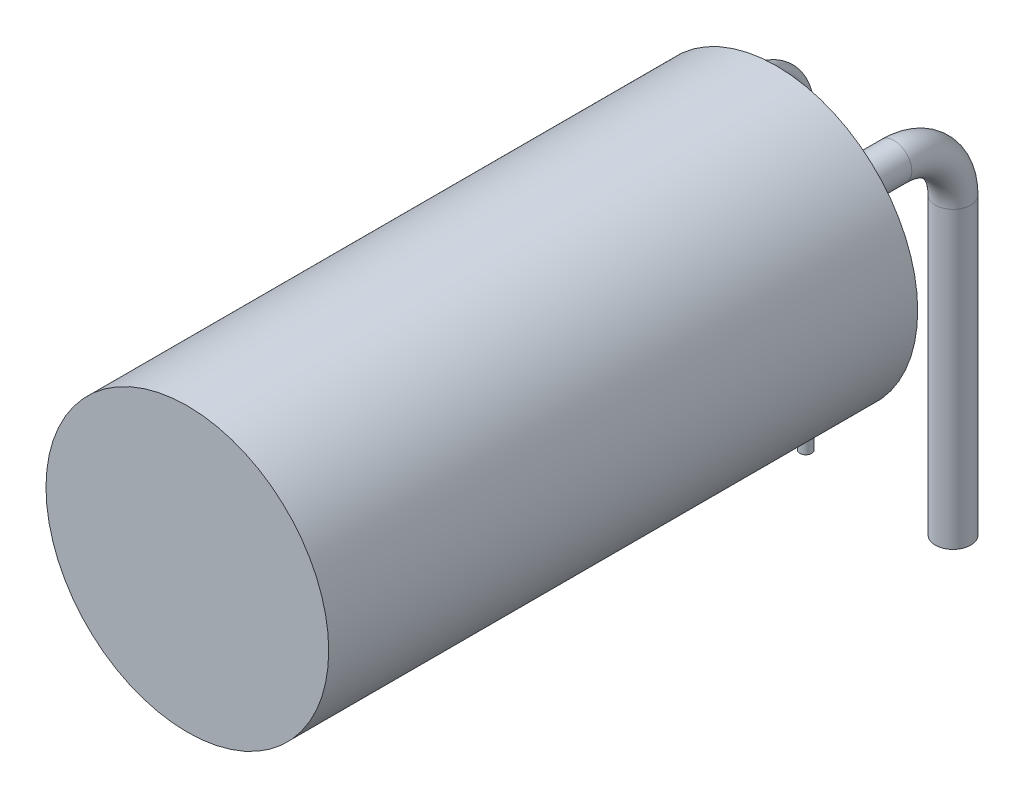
ISO-10303-21;
HEADER;
FILE_DESCRIPTION(('STEP AP214'),'2;1');
FILE_NAME('part.step','',(''),(''),'','','');
FILE_SCHEMA(('AUTOMOTIVE_DESIGN { 1 0 10303 214 1 1 1 1 }'));
ENDSEC;
DATA;
#1=APPLICATION_CONTEXT('core data for automotive mechanical design processes');
#2=APPLICATION_PROTOCOL_DEFINITION('international standard','automotive_design',2000,#1);
#3=PRODUCT_CONTEXT('',#1,'mechanical');
#4=PRODUCT('Part','Part','',(#3));
#5=PRODUCT_RELATED_PRODUCT_CATEGORY('part','',(#4));
#6=PRODUCT_DEFINITION_FORMATION('','',#4);
#7=PRODUCT_DEFINITION_CONTEXT('part definition',#1,'design');
#8=PRODUCT_DEFINITION('design','',#6,#7);
#9=PRODUCT_DEFINITION_SHAPE('','',#8);
#10=(LENGTH_UNIT() NAMED_UNIT(*) SI_UNIT(.MILLI.,.METRE.));
#11=(NAMED_UNIT(*) PLANE_ANGLE_UNIT() SI_UNIT($,.RADIAN.));
#12=(NAMED_UNIT(*) SI_UNIT($,.STERADIAN.) SOLID_ANGLE_UNIT());
#13=UNCERTAINTY_MEASURE_WITH_UNIT(LENGTH_MEASURE(1.E-05),#10,'distance_accuracy_value','');
#14=(GEOMETRIC_REPRESENTATION_CONTEXT(3) GLOBAL_UNCERTAINTY_ASSIGNED_CONTEXT((#13)) GLOBAL_UNIT_ASSIGNED_CONTEXT((#10,
#11,#12)) REPRESENTATION_CONTEXT('',''));
#15=CARTESIAN_POINT('',(0.,0.,0.));
#16=DIRECTION('',(0.,0.,1.));
#17=DIRECTION('',(1.,0.,0.));
#18=AXIS2_PLACEMENT_3D('',#15,#16,#17);
#19=CARTESIAN_POINT('',(0.,0.,0.));
#20=DIRECTION('',(0.,0.,1.));
#21=DIRECTION('',(1.,0.,0.));
#22=AXIS2_PLACEMENT_3D('',#19,#20,#21);
#23=PLANE('',#22);
#24=CARTESIAN_POINT('',(0.,0.,0.));
#25=DIRECTION('',(0.,0.,1.));
#26=DIRECTION('',(1.,0.,0.));
#27=AXIS2_PLACEMENT_3D('',#24,#25,#26);
#28=CIRCLE('',#27,2.4);
#29=CARTESIAN_POINT('',(-2.39996174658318,-0.0135504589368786,0.));
#30=VERTEX_POINT('',#29);
#31=CARTESIAN_POINT('',(-2.39996174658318,0.0135504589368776,0.));
#32=VERTEX_POINT('',#31);
#33=EDGE_CURVE('E38',#30,#32,#28,.T.);
#34=ORIENTED_EDGE('',*,*,#33,.F.);
#35=CARTESIAN_POINT('',(-2.39996174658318,-0.0135504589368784,0.));
#36=CARTESIAN_POINT('',(-2.39820142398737,0.,0.));
#37=CARTESIAN_POINT('',(-2.39996174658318,0.013550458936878,0.));
#38=B_SPLINE_CURVE_WITH_KNOTS('',2,(#35,#36,#37),.UNSPECIFIED.,.F.,.F.,(3,3),(0.,1.),.UNSPECIFIED.);
#39=EDGE_CURVE('E99',#30,#32,#38,.T.);
#40=ORIENTED_EDGE('',*,*,#39,.T.);
#41=EDGE_LOOP('',(#34,#40));
#42=FACE_BOUND('',#41,.T.);
#43=CARTESIAN_POINT('',(0.,0.,0.));
#44=DIRECTION('',(0.,0.,-1.));
#45=DIRECTION('',(-1.,0.,0.));
#46=AXIS2_PLACEMENT_3D('',#43,#44,#45);
#47=CIRCLE('',#46,0.3);
#48=CARTESIAN_POINT('',(-0.3,0.,0.));
#49=VERTEX_POINT('',#48);
#50=EDGE_CURVE('E68',#49,#49,#47,.T.);
#51=ORIENTED_EDGE('',*,*,#50,.F.);
#52=EDGE_LOOP('',(#51));
#53=FACE_BOUND('',#52,.T.);
#54=ADVANCED_FACE('F33',(#42,#53),#23,.F.);
#55=CARTESIAN_POINT('',(0.,0.,10.));
#56=DIRECTION('',(0.,0.,-1.));
#57=DIRECTION('',(-1.,0.,0.));
#58=AXIS2_PLACEMENT_3D('',#55,#56,#57);
#59=CYLINDRICAL_SURFACE('',#58,2.4);
#60=ORIENTED_EDGE('',*,*,#33,.T.);
#61=DIRECTION('',(0.,0.,1.));
#62=VECTOR('',#61,1.);
#63=CARTESIAN_POINT('',(-2.39996174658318,0.0135504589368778,-0.749999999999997));
#64=LINE('',#63,#62);
#65=CARTESIAN_POINT('',(-2.39996174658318,0.0135504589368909,0.5));
#66=VERTEX_POINT('',#65);
#67=EDGE_CURVE('E11',#32,#66,#64,.T.);
#68=ORIENTED_EDGE('',*,*,#67,.T.);
#69=CARTESIAN_POINT('',(0.,0.,0.5));
#70=DIRECTION('',(0.,0.,1.));
#71=DIRECTION('',(-0.999984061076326,0.0056460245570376,0.));
#72=AXIS2_PLACEMENT_3D('',#69,#70,#71);
#73=CIRCLE('',#72,2.4);
#74=CARTESIAN_POINT('',(-2.39996174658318,-0.0135504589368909,0.5));
#75=VERTEX_POINT('',#74);
#76=EDGE_CURVE('E62',#66,#75,#73,.T.);
#77=ORIENTED_EDGE('',*,*,#76,.T.);
#78=DIRECTION('',(0.,0.,1.));
#79=VECTOR('',#78,1.);
#80=CARTESIAN_POINT('',(-2.39996174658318,-0.0135504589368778,-0.749999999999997));
#81=LINE('',#80,#79);
#82=EDGE_CURVE('E44',#75,#30,#81,.F.);
#83=ORIENTED_EDGE('',*,*,#82,.T.);
#84=EDGE_LOOP('',(#60,#68,#77,#83));
#85=FACE_BOUND('',#84,.T.);
#86=CARTESIAN_POINT('',(0.,0.,10.));
#87=DIRECTION('',(0.,0.,1.));
#88=DIRECTION('',(1.,0.,0.));
#89=AXIS2_PLACEMENT_3D('',#86,#87,#88);
#90=CIRCLE('',#89,2.4);
#91=CARTESIAN_POINT('',(2.4,0.,10.));
#92=VERTEX_POINT('',#91);
#93=EDGE_CURVE('E78',#92,#92,#90,.T.);
#94=ORIENTED_EDGE('',*,*,#93,.F.);
#95=EDGE_LOOP('',(#94));
#96=FACE_BOUND('',#95,.T.);
#97=ADVANCED_FACE('F35',(#85,#96),#59,.T.);
#98=CARTESIAN_POINT('',(0.,0.,10.));
#99=DIRECTION('',(0.,0.,1.));
#100=DIRECTION('',(1.,0.,0.));
#101=AXIS2_PLACEMENT_3D('',#98,#99,#100);
#102=PLANE('',#101);
#103=ORIENTED_EDGE('',*,*,#93,.T.);
#104=EDGE_LOOP('',(#103));
#105=FACE_BOUND('',#104,.T.);
#106=ADVANCED_FACE('F113',(#105),#102,.T.);
#107=CARTESIAN_POINT('',(0.,-1.00000000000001,-3.));
#108=DIRECTION('',(0.,-1.,0.));
#109=DIRECTION('',(0.,0.,-1.));
#110=AXIS2_PLACEMENT_3D('',#107,#108,#109);
#111=CYLINDRICAL_SURFACE('',#110,0.3);
#112=CARTESIAN_POINT('',(0.,-1.00000000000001,-3.));
#113=DIRECTION('',(0.,-1.,0.));
#114=DIRECTION('',(-1.,0.,0.));
#115=AXIS2_PLACEMENT_3D('',#112,#113,#114);
#116=CIRCLE('',#115,0.3);
#117=CARTESIAN_POINT('',(0.,-1.00000000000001,-3.3));
#118=VERTEX_POINT('',#117);
#119=EDGE_CURVE('E83',#118,#118,#116,.T.);
#120=ORIENTED_EDGE('',*,*,#119,.T.);
#121=EDGE_LOOP('',(#120));
#122=FACE_BOUND('',#121,.T.);
#123=CARTESIAN_POINT('',(0.,-6.,-3.));
#124=DIRECTION('',(0.,-1.,0.));
#125=DIRECTION('',(-1.,0.,0.));
#126=AXIS2_PLACEMENT_3D('',#123,#124,#125);
#127=CIRCLE('',#126,0.3);
#128=CARTESIAN_POINT('',(-0.3,-6.,-3.));
#129=VERTEX_POINT('',#128);
#130=EDGE_CURVE('E79',#129,#129,#127,.T.);
#131=ORIENTED_EDGE('',*,*,#130,.F.);
#132=EDGE_LOOP('',(#131));
#133=FACE_BOUND('',#132,.T.);
#134=ADVANCED_FACE('F111',(#122,#133),#111,.T.);
#135=CARTESIAN_POINT('',(0.,-1.,-2.));
#136=DIRECTION('',(-1.,0.,0.));
#137=DIRECTION('',(0.,0.,1.));
#138=AXIS2_PLACEMENT_3D('',#135,#136,#137);
#139=TOROIDAL_SURFACE('',#138,1.,0.3);
#140=CARTESIAN_POINT('',(0.,0.,-1.99999999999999));
#141=DIRECTION('',(0.,0.,-1.));
#142=DIRECTION('',(-1.,0.,0.));
#143=AXIS2_PLACEMENT_3D('',#140,#141,#142);
#144=CIRCLE('',#143,0.3);
#145=CARTESIAN_POINT('',(0.,0.3,-1.99999999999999));
#146=VERTEX_POINT('',#145);
#147=EDGE_CURVE('E88',#146,#146,#144,.T.);
#148=CARTESIAN_POINT('',(0.,-1.,-2.));
#149=DIRECTION('',(-1.,0.,0.));
#150=DIRECTION('',(0.,0.,1.));
#151=AXIS2_PLACEMENT_3D('',#148,#149,#150);
#152=CIRCLE('',#151,1.3);
#153=EDGE_CURVE('',#146,#118,#152,.T.);
#154=ORIENTED_EDGE('',*,*,#147,.T.);
#155=ORIENTED_EDGE('',*,*,#119,.F.);
#156=ORIENTED_EDGE('',*,*,#153,.T.);
#157=ORIENTED_EDGE('',*,*,#153,.F.);
#158=EDGE_LOOP('',(#154,#156,#155,#157));
#159=FACE_BOUND('',#158,.T.);
#160=ADVANCED_FACE('F120',(#159),#139,.T.);
#161=CARTESIAN_POINT('',(0.,0.,-1.99999999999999));
#162=DIRECTION('',(0.,0.,1.));
#163=DIRECTION('',(1.,0.,0.));
#164=AXIS2_PLACEMENT_3D('',#161,#162,#163);
#165=CYLINDRICAL_SURFACE('',#164,0.3);
#166=ORIENTED_EDGE('',*,*,#147,.F.);
#167=EDGE_LOOP('',(#166));
#168=FACE_BOUND('',#167,.T.);
#169=ORIENTED_EDGE('',*,*,#50,.T.);
#170=EDGE_LOOP('',(#169));
#171=FACE_BOUND('',#170,.T.);
#172=ADVANCED_FACE('F142',(#168,#171),#165,.T.);
#173=CARTESIAN_POINT('',(0.,-6.,-3.));
#174=DIRECTION('',(0.,-1.,0.));
#175=DIRECTION('',(-1.,0.,0.));
#176=AXIS2_PLACEMENT_3D('',#173,#174,#175);
#177=PLANE('',#176);
#178=ORIENTED_EDGE('',*,*,#130,.T.);
#179=EDGE_LOOP('',(#178));
#180=FACE_BOUND('',#179,.T.);
#181=ADVANCED_FACE('F137',(#180),#177,.T.);
#182=CARTESIAN_POINT('',(-2.5,0.,-1.99999999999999));
#183=DIRECTION('',(0.,0.,1.));
#184=DIRECTION('',(1.,0.,0.));
#185=AXIS2_PLACEMENT_3D('',#182,#183,#184);
#186=CYLINDRICAL_SURFACE('',#185,0.100951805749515);
#187=CARTESIAN_POINT('',(-2.5,0.,-1.99999999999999));
#188=DIRECTION('',(0.,0.,1.));
#189=DIRECTION('',(1.,0.,0.));
#190=AXIS2_PLACEMENT_3D('',#187,#188,#189);
#191=CIRCLE('',#190,0.100951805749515);
#192=CARTESIAN_POINT('',(-2.5,0.100951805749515,-1.99999999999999));
#193=VERTEX_POINT('',#192);
#194=EDGE_CURVE('E72',#193,#193,#191,.T.);
#195=ORIENTED_EDGE('',*,*,#194,.T.);
#196=EDGE_LOOP('',(#195));
#197=FACE_BOUND('',#196,.T.);
#198=ORIENTED_EDGE('',*,*,#67,.F.);
#199=ORIENTED_EDGE('',*,*,#39,.F.);
#200=ORIENTED_EDGE('',*,*,#82,.F.);
#201=CARTESIAN_POINT('',(-2.5,0.,0.5));
#202=DIRECTION('',(0.,0.,1.));
#203=DIRECTION('',(1.,0.,0.));
#204=AXIS2_PLACEMENT_3D('',#201,#202,#203);
#205=CIRCLE('',#204,0.100951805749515);
#206=EDGE_CURVE('E51',#66,#75,#205,.T.);
#207=ORIENTED_EDGE('',*,*,#206,.F.);
#208=EDGE_LOOP('',(#198,#199,#200,#207));
#209=FACE_BOUND('',#208,.T.);
#210=ADVANCED_FACE('F71',(#197,#209),#186,.T.);
#211=CARTESIAN_POINT('',(-2.5,0.,0.5));
#212=DIRECTION('',(0.,0.,1.));
#213=DIRECTION('',(1.,0.,0.));
#214=AXIS2_PLACEMENT_3D('',#211,#212,#213);
#215=PLANE('',#214);
#216=ORIENTED_EDGE('',*,*,#76,.F.);
#217=ORIENTED_EDGE('',*,*,#206,.T.);
#218=EDGE_LOOP('',(#216,#217));
#219=FACE_BOUND('',#218,.T.);
#220=ADVANCED_FACE('F64',(#219),#215,.T.);
#221=CARTESIAN_POINT('',(-2.5,-1.00000000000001,-3.));
#222=DIRECTION('',(0.,-1.,0.));
#223=DIRECTION('',(0.,0.,-1.));
#224=AXIS2_PLACEMENT_3D('',#221,#222,#223);
#225=CYLINDRICAL_SURFACE('',#224,0.100951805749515);
#226=CARTESIAN_POINT('',(-2.5,-1.00000000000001,-3.));
#227=DIRECTION('',(0.,1.,0.));
#228=DIRECTION('',(1.,0.,0.));
#229=AXIS2_PLACEMENT_3D('',#226,#227,#228);
#230=CIRCLE('',#229,0.100951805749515);
#231=CARTESIAN_POINT('',(-2.5,-1.00000000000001,-3.10095180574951));
#232=VERTEX_POINT('',#231);
#233=EDGE_CURVE('E205',#232,#232,#230,.T.);
#234=ORIENTED_EDGE('',*,*,#233,.F.);
#235=EDGE_LOOP('',(#234));
#236=FACE_BOUND('',#235,.T.);
#237=CARTESIAN_POINT('',(-2.5,-6.,-3.));
#238=DIRECTION('',(0.,1.,0.));
#239=DIRECTION('',(1.,0.,0.));
#240=AXIS2_PLACEMENT_3D('',#237,#238,#239);
#241=CIRCLE('',#240,0.100951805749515);
#242=CARTESIAN_POINT('',(-2.39904819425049,-6.,-3.));
#243=VERTEX_POINT('',#242);
#244=EDGE_CURVE('E203',#243,#243,#241,.T.);
#245=ORIENTED_EDGE('',*,*,#244,.T.);
#246=EDGE_LOOP('',(#245));
#247=FACE_BOUND('',#246,.T.);
#248=ADVANCED_FACE('F178',(#236,#247),#225,.T.);
#249=CARTESIAN_POINT('',(-2.5,-1.,-2.));
#250=DIRECTION('',(-1.,0.,0.));
#251=DIRECTION('',(0.,0.,1.));
#252=AXIS2_PLACEMENT_3D('',#249,#250,#251);
#253=TOROIDAL_SURFACE('',#252,1.,0.100951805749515);
#254=CARTESIAN_POINT('',(-2.5,-1.,-2.));
#255=DIRECTION('',(-1.,0.,0.));
#256=DIRECTION('',(0.,0.,1.));
#257=AXIS2_PLACEMENT_3D('',#254,#255,#256);
#258=CIRCLE('',#257,1.10095180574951);
#259=EDGE_CURVE('',#193,#232,#258,.T.);
#260=ORIENTED_EDGE('',*,*,#194,.F.);
#261=ORIENTED_EDGE('',*,*,#233,.T.);
#262=ORIENTED_EDGE('',*,*,#259,.T.);
#263=ORIENTED_EDGE('',*,*,#259,.F.);
#264=EDGE_LOOP('',(#260,#262,#261,#263));
#265=FACE_BOUND('',#264,.T.);
#266=ADVANCED_FACE('F181',(#265),#253,.T.);
#267=CARTESIAN_POINT('',(-2.5,-6.,-3.));
#268=DIRECTION('',(0.,1.,0.));
#269=DIRECTION('',(1.,0.,0.));
#270=AXIS2_PLACEMENT_3D('',#267,#268,#269);
#271=PLANE('',#270);
#272=ORIENTED_EDGE('',*,*,#244,.F.);
#273=EDGE_LOOP('',(#272));
#274=FACE_BOUND('',#273,.T.);
#275=ADVANCED_FACE('F185',(#274),#271,.F.);
#276=CLOSED_SHELL('',(#54,#97,#106,#134,#160,#172,#181,#210,#220,#248,#266,#275));
#277=MANIFOLD_SOLID_BREP('B2',#276);
#278=ADVANCED_BREP_SHAPE_REPRESENTATION('',(#18,#277),#14);
#279=SHAPE_DEFINITION_REPRESENTATION(#9,#278);
ENDSEC;
END-ISO-10303-21;
